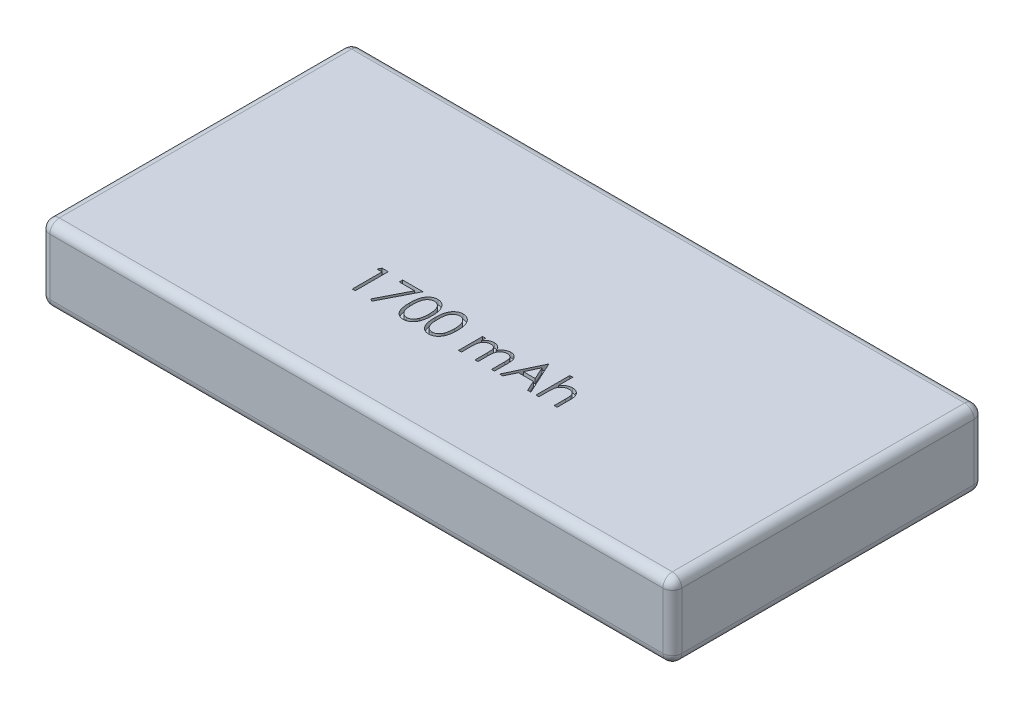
from build123d import *

# Parameters (mm, degrees)
SKETCH1_W           = 67
SKETCH1_H           = 33
BOSS_EXTRUDE1_DEPTH = 8
FILLET1_R           = 1
CUT_EXTRUDE1_DEPTH  = 0.5


with BuildPart() as part:
    # Sketch1 → Boss-Extrude1 (new body)
    with BuildSketch(Plane(origin=(0, 0, 0), x_dir=(1, 0, 0), z_dir=(0, 1, 0))):
        with Locations((33.5, 16.5)):
            Rectangle(SKETCH1_W, SKETCH1_H)
    extrude(amount=BOSS_EXTRUDE1_DEPTH)

    # Fillet1
    fillet1_edges = [part.edges().sort_by_distance(p)[0] for p in [
        (67, 8, -16.5),
        (33.5, 8, -33),
        (0, 8, -16.5),
        (33.5, 0, -33),
        (67, 0, -16.5),
        (33.5, 0, 0),
        (0, 0, -16.5),
        (0, 4, -33),
        (67, 4, -33),
        (67, 4, 0),
        (0, 4, 0),
        (33.5, 8, 0),
    ]]
    fillet(fillet1_edges, radius=FILLET1_R)

    # Sketch2 → Cut-Extrude1 (cut)
    # profile 1 of 7: a face of its own
    with BuildSketch(Plane(origin=(0, 8, 0), x_dir=(1, 0, 0), z_dir=(0, 1, 0))):
        Polygon((22.73427484, 13.5), (23.381410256, 13.5), (23.381410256, 10), (23.067307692, 10), (23.067307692, 13.141025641), (22.528846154, 13.141025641), align=None)
    # profile 2 of 7: a face of its own
    with BuildSketch(Plane(origin=(0, 8, 0), x_dir=(1, 0, 0), z_dir=(0, 1, 0))):
        Polygon((24.907051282, 13.5), (27.060897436, 13.5), (25.221153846, 9.91025641), (24.949819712, 10.059595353), (26.528745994, 13.141025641), (24.907051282, 13.141025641), align=None)
    # profile 3 of 7: a face of its own
    with BuildSketch(Plane(origin=(0, 8, 0), x_dir=(1, 0, 0), z_dir=(0, 1, 0))):
        with BuildLine():
            add(Edge.make_bspline(
                [(27.375, 11.748597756), (27.375328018, 11.804695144), (27.375965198, 11.913665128), (27.383053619, 12.07244977), (27.394828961, 12.221410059), (27.410966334, 12.360553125), (27.430604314, 12.48991489), (27.456819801, 12.609149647), (27.486632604, 12.718809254), (27.52118505, 12.819251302), (27.560172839, 12.911829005), (27.602607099, 12.998254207), (27.650171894, 13.078396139), (27.700148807, 13.153533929), (27.754560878, 13.222437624), (27.811859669, 13.286080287), (27.874281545, 13.342991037), (27.939704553, 13.394837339), (28.008721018, 13.440286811), (28.079363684, 13.48031955), (28.15211879, 13.514519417), (28.227184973, 13.541409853), (28.30388753, 13.5636207), (28.382494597, 13.578809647), (28.463135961, 13.588366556), (28.517567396, 13.589280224), (28.545172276, 13.58974359)],
                knots=[0, 0, 0, 0, 1.646270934, 3.197905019, 4.663502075, 6.030701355, 7.308322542, 8.50163776, 9.611534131, 10.641858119, 11.616356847, 12.558055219, 13.465016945, 14.349605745, 15.204443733, 16.039544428, 16.859896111, 17.680448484, 18.487036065, 19.28249412, 20.06191084, 20.843045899, 21.620316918, 22.403196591, 23.190181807, 24, 24, 24, 24], degree=3))
            add(Edge.make_bspline(
                [(28.545172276, 13.58974359), (28.573007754, 13.589255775), (28.628363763, 13.588285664), (28.710204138, 13.578961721), (28.79015382, 13.563490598), (28.867871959, 13.541569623), (28.943996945, 13.514373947), (29.017933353, 13.48028683), (29.090140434, 13.440607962), (29.159470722, 13.393984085), (29.226685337, 13.342001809), (29.2901333, 13.28323914), (29.349820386, 13.218289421), (29.406495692, 13.147847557), (29.458551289, 13.070562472), (29.508124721, 12.987778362), (29.552496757, 12.898047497), (29.595231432, 12.80286703), (29.632118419, 12.699603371), (29.665384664, 12.58883861), (29.692263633, 12.469264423), (29.714652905, 12.341508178), (29.731997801, 12.205100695), (29.744630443, 12.060334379), (29.751303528, 11.907113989), (29.752560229, 11.80235614), (29.753205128, 11.748597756)],
                knots=[0, 0, 0, 0, 0.810914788, 1.612654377, 2.396697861, 3.181598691, 3.963628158, 4.749916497, 5.551656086, 6.361998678, 7.18212741, 8.025565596, 8.878627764, 9.750805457, 10.657531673, 11.591944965, 12.560506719, 13.57287815, 14.630710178, 15.753379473, 16.941251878, 18.199788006, 19.531962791, 20.947069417, 22.433333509, 24, 24, 24, 24], degree=3))
            add(Edge.make_bspline(
                [(29.753205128, 11.748597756), (29.752553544, 11.695073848), (29.751283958, 11.590784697), (29.744705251, 11.438253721), (29.73174662, 11.294255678), (29.715536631, 11.158445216), (29.693085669, 11.031387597), (29.665480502, 10.912643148), (29.634830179, 10.801699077), (29.596995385, 10.699464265), (29.555584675, 10.604512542), (29.510529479, 10.515845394), (29.462259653, 10.432679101), (29.409670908, 10.355679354), (29.353617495, 10.284300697), (29.292899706, 10.219803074), (29.229229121, 10.160632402), (29.161816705, 10.107980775), (29.091405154, 10.06189597), (29.019446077, 10.02068212), (28.944662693, 9.987449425), (28.868749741, 9.958914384), (28.790621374, 9.937113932), (28.710374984, 9.922040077), (28.628418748, 9.911468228), (28.573017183, 9.910661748), (28.545172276, 9.91025641)],
                knots=[0, 0, 0, 0, 1.561518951, 3.042555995, 4.452378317, 5.7783523, 7.031515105, 8.214008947, 9.334062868, 10.386615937, 11.391082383, 12.354592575, 13.286541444, 14.194233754, 15.072674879, 15.931287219, 16.775624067, 17.606195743, 18.42308326, 19.229000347, 20.022332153, 20.807536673, 21.593273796, 22.3848459, 23.188221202, 24, 24, 24, 24], degree=3))
            add(Edge.make_bspline(
                [(28.545172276, 9.91025641), (28.517568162, 9.910722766), (28.463138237, 9.911642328), (28.382485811, 9.921156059), (28.304203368, 9.936451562), (28.227904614, 9.957868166), (28.153198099, 9.984083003), (28.081101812, 10.018236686), (28.010814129, 10.057570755), (27.942522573, 10.102366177), (27.877510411, 10.15368786), (27.815411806, 10.210452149), (27.757786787, 10.27407556), (27.704152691, 10.343553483), (27.653178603, 10.418246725), (27.60628923, 10.499175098), (27.562918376, 10.586017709), (27.523274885, 10.67933562), (27.488126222, 10.780490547), (27.457078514, 10.890639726), (27.432564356, 11.010755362), (27.411581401, 11.139872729), (27.394657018, 11.278546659), (27.383102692, 11.426852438), (27.375961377, 11.584697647), (27.375326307, 11.692967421), (27.375, 11.748597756)],
                knots=[0, 0, 0, 0, 0.810891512, 1.598919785, 2.382837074, 3.152667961, 3.926044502, 4.706494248, 5.493654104, 6.291793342, 7.103789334, 7.925228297, 8.761435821, 9.622817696, 10.50288917, 11.416980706, 12.369136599, 13.353924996, 14.394355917, 15.514179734, 16.714354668, 17.994756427, 19.357759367, 20.818452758, 22.365282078, 24, 24, 24, 24], degree=3))
        make_face()
        with BuildLine():
            add(Edge.make_bspline(
                [(27.689102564, 11.75), (27.689222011, 11.703251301), (27.689453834, 11.612521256), (27.695510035, 11.480677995), (27.703760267, 11.357707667), (27.714401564, 11.24345413), (27.730204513, 11.138304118), (27.747911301, 11.041534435), (27.76945939, 10.953657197), (27.794954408, 10.874069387), (27.823993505, 10.801420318), (27.855699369, 10.733819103), (27.889760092, 10.670467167), (27.927879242, 10.611933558), (27.969394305, 10.558027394), (28.013367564, 10.507794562), (28.061440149, 10.462997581), (28.127943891, 10.409270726), (28.215740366, 10.353751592), (28.326360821, 10.305405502), (28.440029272, 10.275023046), (28.517180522, 10.27115929), (28.555689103, 10.269230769)],
                knots=[0, 0, 0, 0, 1.459021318, 2.831673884, 4.118529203, 5.306027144, 6.411944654, 7.436330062, 8.375795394, 9.233974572, 10.042671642, 10.816086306, 11.563610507, 12.285937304, 12.993564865, 13.685989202, 14.367179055, 15.041617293, 16.353048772, 17.594441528, 18.799311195, 20, 20, 20, 20], degree=3))
            add(Edge.make_bspline(
                [(28.555689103, 10.269230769), (28.594446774, 10.27082855), (28.671882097, 10.274020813), (28.785015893, 10.30481955), (28.894846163, 10.35128909), (28.980918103, 10.406236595), (29.046400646, 10.458564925), (29.093317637, 10.503179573), (29.136379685, 10.55313544), (29.17722176, 10.607034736), (29.214680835, 10.66590722), (29.248743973, 10.729469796), (29.279827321, 10.797898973), (29.297536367, 10.845668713), (29.306590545, 10.870092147)],
                knots=[0, 0, 0, 0, 1.353760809, 2.704726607, 4.075137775, 5.516104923, 6.260822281, 7.007110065, 7.778089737, 8.566572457, 9.372053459, 10.217411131, 11.088608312, 12, 12, 12, 12], degree=3))
            add(Edge.make_bspline(
                [(29.306590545, 10.870092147), (29.317142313, 10.901321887), (29.338566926, 10.964731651), (29.366178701, 11.063095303), (29.3879241, 11.166298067), (29.407487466, 11.273723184), (29.420840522, 11.386162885), (29.431588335, 11.503269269), (29.437919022, 11.625130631), (29.438703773, 11.707925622), (29.439102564, 11.75)],
                knots=[0, 0, 0, 0, 0.884706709, 1.796334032, 2.740027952, 3.714592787, 4.726048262, 5.777819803, 6.87074269, 8, 8, 8, 8], degree=3))
            add(Edge.make_bspline(
                [(29.439102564, 11.75), (29.438552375, 11.792067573), (29.437476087, 11.874360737), (29.433362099, 11.994878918), (29.422738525, 12.109346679), (29.410939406, 12.218257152), (29.393542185, 12.321007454), (29.374784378, 12.418457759), (29.349583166, 12.509400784), (29.322663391, 12.595260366), (29.291852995, 12.675061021), (29.257937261, 12.749174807), (29.221715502, 12.817959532), (29.182373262, 12.881226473), (29.140377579, 12.939259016), (29.09462003, 12.990893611), (29.046915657, 13.037730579), (28.980098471, 13.091193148), (28.892624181, 13.145704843), (28.783778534, 13.195870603), (28.67050789, 13.224678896), (28.593934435, 13.228740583), (28.555689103, 13.230769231)],
                knots=[0, 0, 0, 0, 1.31362396, 2.569729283, 3.763502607, 4.902122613, 5.988968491, 7.01645872, 7.998833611, 8.933434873, 9.825090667, 10.667526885, 11.477055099, 12.250526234, 12.991942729, 13.710640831, 14.402115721, 15.076753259, 16.378508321, 17.609869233, 18.806226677, 20, 20, 20, 20], degree=3))
            add(Edge.make_bspline(
                [(28.555689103, 13.230769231), (28.51697851, 13.228737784), (28.439486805, 13.22467119), (28.32503885, 13.195977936), (28.215334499, 13.14596497), (28.128091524, 13.091012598), (28.061227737, 13.038674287), (28.014145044, 12.993287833), (27.969998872, 12.943641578), (27.929331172, 12.889239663), (27.891241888, 12.830774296), (27.856260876, 12.767785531), (27.824743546, 12.699954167), (27.79565901, 12.627337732), (27.770086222, 12.547756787), (27.748992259, 12.459987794), (27.729505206, 12.363525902), (27.715709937, 12.257806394), (27.703446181, 12.14352424), (27.695564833, 12.020246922), (27.689433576, 11.888182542), (27.689215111, 11.796983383), (27.689102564, 11.75)],
                knots=[0, 0, 0, 0, 1.207732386, 2.417664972, 3.655092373, 4.956220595, 5.625982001, 6.301752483, 6.994047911, 7.697131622, 8.419323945, 9.170223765, 9.943494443, 10.752040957, 11.610060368, 12.549350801, 13.567764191, 14.679664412, 15.874934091, 17.154273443, 18.533957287, 20, 20, 20, 20], degree=3))
        make_face(mode=Mode.SUBTRACT)
    # profile 4 of 7: a face of its own
    with BuildSketch(Plane(origin=(0, 8, 0), x_dir=(1, 0, 0), z_dir=(0, 1, 0))):
        with BuildLine():
            add(Edge.make_bspline(
                [(30.067307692, 11.748597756), (30.06763571, 11.804695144), (30.06827289, 11.913665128), (30.075361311, 12.07244977), (30.087136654, 12.221410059), (30.103274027, 12.360553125), (30.122912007, 12.48991489), (30.149127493, 12.609149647), (30.178940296, 12.718809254), (30.213492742, 12.819251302), (30.252480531, 12.911829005), (30.294914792, 12.998254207), (30.342479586, 13.078396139), (30.392456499, 13.153533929), (30.446868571, 13.222437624), (30.504167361, 13.286080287), (30.566589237, 13.342991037), (30.632012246, 13.394837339), (30.70102871, 13.440286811), (30.771671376, 13.48031955), (30.844426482, 13.514519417), (30.919492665, 13.541409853), (30.996195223, 13.5636207), (31.074802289, 13.578809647), (31.155443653, 13.588366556), (31.209875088, 13.589280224), (31.237479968, 13.58974359)],
                knots=[0, 0, 0, 0, 1.646270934, 3.197905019, 4.663502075, 6.030701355, 7.308322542, 8.50163776, 9.611534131, 10.641858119, 11.616356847, 12.558055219, 13.465016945, 14.349605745, 15.204443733, 16.039544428, 16.859896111, 17.680448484, 18.487036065, 19.28249412, 20.06191084, 20.843045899, 21.620316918, 22.403196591, 23.190181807, 24, 24, 24, 24], degree=3))
            add(Edge.make_bspline(
                [(31.237479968, 13.58974359), (31.265315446, 13.589255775), (31.320671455, 13.588285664), (31.402511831, 13.578961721), (31.482461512, 13.563490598), (31.560179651, 13.541569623), (31.636304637, 13.514373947), (31.710241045, 13.48028683), (31.782448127, 13.440607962), (31.851778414, 13.393984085), (31.91899303, 13.342001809), (31.982440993, 13.28323914), (32.042128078, 13.218289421), (32.098803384, 13.147847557), (32.150858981, 13.070562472), (32.200432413, 12.987778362), (32.244804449, 12.898047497), (32.287539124, 12.80286703), (32.324426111, 12.699603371), (32.357692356, 12.58883861), (32.384571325, 12.469264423), (32.406960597, 12.341508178), (32.424305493, 12.205100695), (32.436938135, 12.060334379), (32.44361122, 11.907113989), (32.444867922, 11.80235614), (32.445512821, 11.748597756)],
                knots=[0, 0, 0, 0, 0.810914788, 1.612654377, 2.396697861, 3.181598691, 3.963628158, 4.749916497, 5.551656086, 6.361998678, 7.18212741, 8.025565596, 8.878627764, 9.750805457, 10.657531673, 11.591944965, 12.560506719, 13.57287815, 14.630710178, 15.753379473, 16.941251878, 18.199788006, 19.531962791, 20.947069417, 22.433333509, 24, 24, 24, 24], degree=3))
            add(Edge.make_bspline(
                [(32.445512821, 11.748597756), (32.444861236, 11.695073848), (32.44359165, 11.590784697), (32.437012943, 11.438253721), (32.424054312, 11.294255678), (32.407844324, 11.158445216), (32.385393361, 11.031387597), (32.357788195, 10.912643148), (32.327137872, 10.801699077), (32.289303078, 10.699464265), (32.247892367, 10.604512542), (32.202837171, 10.515845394), (32.154567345, 10.432679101), (32.1019786, 10.355679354), (32.045925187, 10.284300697), (31.985207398, 10.219803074), (31.921536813, 10.160632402), (31.854124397, 10.107980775), (31.783712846, 10.06189597), (31.711753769, 10.02068212), (31.636970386, 9.987449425), (31.561057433, 9.958914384), (31.482929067, 9.937113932), (31.402682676, 9.922040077), (31.32072644, 9.911468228), (31.265324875, 9.910661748), (31.237479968, 9.91025641)],
                knots=[0, 0, 0, 0, 1.561518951, 3.042555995, 4.452378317, 5.7783523, 7.031515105, 8.214008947, 9.334062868, 10.386615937, 11.391082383, 12.354592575, 13.286541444, 14.194233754, 15.072674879, 15.931287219, 16.775624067, 17.606195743, 18.42308326, 19.229000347, 20.022332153, 20.807536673, 21.593273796, 22.3848459, 23.188221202, 24, 24, 24, 24], degree=3))
            add(Edge.make_bspline(
                [(31.237479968, 9.91025641), (31.209875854, 9.910722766), (31.155445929, 9.911642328), (31.074793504, 9.921156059), (30.99651106, 9.936451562), (30.920212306, 9.957868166), (30.845505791, 9.984083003), (30.773409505, 10.018236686), (30.703121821, 10.057570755), (30.634830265, 10.102366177), (30.569818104, 10.15368786), (30.507719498, 10.210452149), (30.450094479, 10.27407556), (30.396460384, 10.343553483), (30.345486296, 10.418246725), (30.298596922, 10.499175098), (30.255226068, 10.586017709), (30.215582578, 10.67933562), (30.180433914, 10.780490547), (30.149386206, 10.890639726), (30.124872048, 11.010755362), (30.103889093, 11.139872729), (30.08696471, 11.278546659), (30.075410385, 11.426852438), (30.06826907, 11.584697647), (30.067633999, 11.692967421), (30.067307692, 11.748597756)],
                knots=[0, 0, 0, 0, 0.810891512, 1.598919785, 2.382837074, 3.152667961, 3.926044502, 4.706494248, 5.493654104, 6.291793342, 7.103789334, 7.925228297, 8.761435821, 9.622817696, 10.50288917, 11.416980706, 12.369136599, 13.353924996, 14.394355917, 15.514179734, 16.714354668, 17.994756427, 19.357759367, 20.818452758, 22.365282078, 24, 24, 24, 24], degree=3))
        make_face()
        with BuildLine():
            add(Edge.make_bspline(
                [(30.381410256, 11.75), (30.381529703, 11.703251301), (30.381761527, 11.612521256), (30.387817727, 11.480677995), (30.396067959, 11.357707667), (30.406709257, 11.24345413), (30.422512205, 11.138304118), (30.440218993, 11.041534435), (30.461767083, 10.953657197), (30.4872621, 10.874069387), (30.516301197, 10.801420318), (30.548007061, 10.733819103), (30.582067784, 10.670467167), (30.620186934, 10.611933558), (30.661701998, 10.558027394), (30.705675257, 10.507794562), (30.753747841, 10.462997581), (30.820251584, 10.409270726), (30.908048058, 10.353751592), (31.018668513, 10.305405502), (31.132336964, 10.275023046), (31.209488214, 10.27115929), (31.247996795, 10.269230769)],
                knots=[0, 0, 0, 0, 1.459021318, 2.831673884, 4.118529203, 5.306027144, 6.411944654, 7.436330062, 8.375795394, 9.233974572, 10.042671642, 10.816086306, 11.563610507, 12.285937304, 12.993564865, 13.685989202, 14.367179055, 15.041617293, 16.353048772, 17.594441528, 18.799311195, 20, 20, 20, 20], degree=3))
            add(Edge.make_bspline(
                [(31.247996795, 10.269230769), (31.286754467, 10.27082855), (31.36418979, 10.274020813), (31.477323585, 10.30481955), (31.587153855, 10.35128909), (31.673225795, 10.406236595), (31.738708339, 10.458564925), (31.785625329, 10.503179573), (31.828687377, 10.55313544), (31.869529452, 10.607034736), (31.906988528, 10.66590722), (31.941051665, 10.729469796), (31.972135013, 10.797898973), (31.989844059, 10.845668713), (31.998898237, 10.870092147)],
                knots=[0, 0, 0, 0, 1.353760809, 2.704726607, 4.075137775, 5.516104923, 6.260822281, 7.007110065, 7.778089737, 8.566572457, 9.372053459, 10.217411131, 11.088608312, 12, 12, 12, 12], degree=3))
            add(Edge.make_bspline(
                [(31.998898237, 10.870092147), (32.009450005, 10.901321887), (32.030874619, 10.964731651), (32.058486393, 11.063095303), (32.080231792, 11.166298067), (32.099795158, 11.273723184), (32.113148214, 11.386162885), (32.123896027, 11.503269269), (32.130226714, 11.625130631), (32.131011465, 11.707925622), (32.131410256, 11.75)],
                knots=[0, 0, 0, 0, 0.884706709, 1.796334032, 2.740027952, 3.714592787, 4.726048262, 5.777819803, 6.87074269, 8, 8, 8, 8], degree=3))
            add(Edge.make_bspline(
                [(32.131410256, 11.75), (32.130860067, 11.792067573), (32.129783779, 11.874360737), (32.125669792, 11.994878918), (32.115046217, 12.109346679), (32.103247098, 12.218257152), (32.085849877, 12.321007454), (32.06709207, 12.418457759), (32.041890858, 12.509400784), (32.014971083, 12.595260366), (31.984160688, 12.675061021), (31.950244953, 12.749174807), (31.914023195, 12.817959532), (31.874680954, 12.881226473), (31.832685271, 12.939259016), (31.786927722, 12.990893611), (31.739223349, 13.037730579), (31.672406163, 13.091193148), (31.584931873, 13.145704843), (31.476086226, 13.195870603), (31.362815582, 13.224678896), (31.286242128, 13.228740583), (31.247996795, 13.230769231)],
                knots=[0, 0, 0, 0, 1.31362396, 2.569729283, 3.763502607, 4.902122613, 5.988968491, 7.01645872, 7.998833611, 8.933434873, 9.825090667, 10.667526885, 11.477055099, 12.250526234, 12.991942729, 13.710640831, 14.402115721, 15.076753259, 16.378508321, 17.609869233, 18.806226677, 20, 20, 20, 20], degree=3))
            add(Edge.make_bspline(
                [(31.247996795, 13.230769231), (31.209286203, 13.228737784), (31.131794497, 13.22467119), (31.017346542, 13.195977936), (30.907642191, 13.14596497), (30.820399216, 13.091012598), (30.75353543, 13.038674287), (30.706452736, 12.993287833), (30.662306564, 12.943641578), (30.621638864, 12.889239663), (30.583549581, 12.830774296), (30.548568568, 12.767785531), (30.517051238, 12.699954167), (30.487966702, 12.627337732), (30.462393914, 12.547756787), (30.441299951, 12.459987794), (30.421812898, 12.363525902), (30.408017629, 12.257806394), (30.395753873, 12.14352424), (30.387872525, 12.020246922), (30.381741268, 11.888182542), (30.381522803, 11.796983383), (30.381410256, 11.75)],
                knots=[0, 0, 0, 0, 1.207732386, 2.417664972, 3.655092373, 4.956220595, 5.625982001, 6.301752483, 6.994047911, 7.697131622, 8.419323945, 9.170223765, 9.943494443, 10.752040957, 11.610060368, 12.549350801, 13.567764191, 14.679664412, 15.874934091, 17.154273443, 18.533957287, 20, 20, 20, 20], degree=3))
        make_face(mode=Mode.SUBTRACT)
    # profile 5 of 7: a face of its own
    with BuildSketch(Plane(origin=(0, 8, 0), x_dir=(1, 0, 0), z_dir=(0, 1, 0))):
        with BuildLine():
            Line((34.330128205, 12.557692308), (34.644230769, 12.557692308))
            Line((34.644230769, 12.557692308), (34.644230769, 12.11318109))
            add(Edge.make_bspline(
                [(34.644230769, 12.11318109), (34.672514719, 12.152068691), (34.726709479, 12.226581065), (34.815575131, 12.324771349), (34.904351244, 12.408099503), (34.968284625, 12.451842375), (34.998998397, 12.472856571)],
                knots=[0, 0, 0, 0, 1.134379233, 2.173579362, 3.122582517, 4, 4, 4, 4], degree=3))
            add(Edge.make_bspline(
                [(34.998998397, 12.472856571), (35.04086306, 12.492861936), (35.123860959, 12.532523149), (35.255280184, 12.572756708), (35.389754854, 12.597481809), (35.480563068, 12.600863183), (35.526241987, 12.602564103)],
                knots=[0, 0, 0, 0, 1.014936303, 2.012140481, 3.000054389, 4, 4, 4, 4], degree=3))
            add(Edge.make_bspline(
                [(35.526241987, 12.602564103), (35.557134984, 12.601518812), (35.618270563, 12.599450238), (35.708854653, 12.585990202), (35.796713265, 12.562724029), (35.881327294, 12.530316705), (35.961047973, 12.491070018), (36.034137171, 12.445020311), (36.099761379, 12.393323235), (36.157887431, 12.333644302), (36.210156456, 12.264307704), (36.258235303, 12.183443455), (36.302660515, 12.089235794), (36.327281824, 12.020869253), (36.340244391, 11.984875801)],
                knots=[0, 0, 0, 0, 1.009824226, 1.998387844, 2.986035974, 3.974953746, 4.955485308, 5.885931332, 6.793869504, 7.679848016, 8.601185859, 9.625726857, 10.749998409, 12, 12, 12, 12], degree=3))
            add(Edge.make_bspline(
                [(36.340244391, 11.984875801), (36.353955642, 12.009600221), (36.38093746, 12.058254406), (36.426243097, 12.127112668), (36.473710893, 12.19151946), (36.523745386, 12.251525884), (36.576169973, 12.306835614), (36.631231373, 12.357631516), (36.688616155, 12.40413173), (36.768408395, 12.458454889), (36.872221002, 12.516156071), (37.003109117, 12.566184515), (37.139259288, 12.597100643), (37.231676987, 12.600730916), (37.278345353, 12.602564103)],
                knots=[0, 0, 0, 0, 0.86119277, 1.694706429, 2.50939023, 3.298075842, 4.073795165, 4.829715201, 5.57930267, 6.321991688, 7.768977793, 9.186738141, 10.579381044, 12, 12, 12, 12], degree=3))
            add(Edge.make_bspline(
                [(37.278345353, 12.602564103), (37.321226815, 12.600946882), (37.405150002, 12.597781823), (37.527327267, 12.57292835), (37.641269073, 12.530250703), (37.746746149, 12.472017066), (37.841905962, 12.398837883), (37.924622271, 12.311769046), (37.994392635, 12.211426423), (38.039971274, 12.117034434), (38.070886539, 12.033699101), (38.089947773, 11.96269281), (38.106787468, 11.884541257), (38.120768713, 11.799150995), (38.130987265, 11.706220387), (38.138557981, 11.605901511), (38.143682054, 11.498116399), (38.144044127, 11.423750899), (38.144230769, 11.385416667)],
                knots=[0, 0, 0, 0, 1.209669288, 2.367440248, 3.500751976, 4.631527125, 5.755587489, 6.87532382, 8.007944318, 9.190864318, 9.82315674, 10.514484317, 11.263564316, 12.079023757, 12.955305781, 13.901327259, 14.918167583, 16, 16, 16, 16], degree=3))
            Line((38.144230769, 11.385416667), (38.144230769, 10))
            Line((38.144230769, 10), (37.830128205, 10))
            Line((37.830128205, 10), (37.830128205, 11.38681891))
            add(Edge.make_bspline(
                [(37.830128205, 11.38681891), (37.830050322, 11.419539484), (37.829900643, 11.482423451), (37.827207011, 11.572675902), (37.822131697, 11.654944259), (37.816197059, 11.729116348), (37.807953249, 11.795365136), (37.797307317, 11.853557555), (37.786029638, 11.904151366), (37.767293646, 11.960237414), (37.737345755, 12.022107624), (37.691728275, 12.0888312), (37.634258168, 12.146912), (37.567898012, 12.197330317), (37.492349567, 12.238323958), (37.409084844, 12.267599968), (37.318620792, 12.285722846), (37.255998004, 12.287528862), (37.223657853, 12.288461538)],
                knots=[0, 0, 0, 0, 1.253487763, 2.409012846, 3.458416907, 4.410876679, 5.259312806, 6.014470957, 6.676830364, 7.243083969, 8.276244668, 9.299465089, 10.325150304, 11.392391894, 12.482080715, 13.603491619, 14.762376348, 16, 16, 16, 16], degree=3))
            add(Edge.make_bspline(
                [(37.223657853, 12.288461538), (37.183987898, 12.287045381), (37.105584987, 12.284246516), (36.991139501, 12.255672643), (36.881168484, 12.212592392), (36.778953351, 12.150159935), (36.684925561, 12.075351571), (36.604025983, 11.986401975), (36.537193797, 11.885772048), (36.491939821, 11.792625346), (36.46335052, 11.708955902), (36.444473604, 11.63585853), (36.429790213, 11.552776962), (36.416019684, 11.460269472), (36.407031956, 11.357699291), (36.398863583, 11.24554089), (36.39504272, 11.123456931), (36.394508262, 11.038830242), (36.394230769, 10.994891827)],
                knots=[0, 0, 0, 0, 1.090531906, 2.155305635, 3.229839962, 4.33261226, 5.44038871, 6.529323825, 7.629011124, 8.757537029, 9.370236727, 10.061839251, 10.834451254, 11.692844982, 12.636905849, 13.66920014, 14.789842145, 16, 16, 16, 16], degree=3))
            Line((36.394230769, 10.994891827), (36.394230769, 10))
            Line((36.394230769, 10), (36.080128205, 10))
            Line((36.080128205, 10), (36.080128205, 11.300580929))
            add(Edge.make_bspline(
                [(36.080128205, 11.300580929), (36.080048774, 11.337274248), (36.079895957, 11.407868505), (36.07721964, 11.509102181), (36.072133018, 11.601183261), (36.06625247, 11.684004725), (36.057792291, 11.757416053), (36.048182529, 11.821810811), (36.036833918, 11.877027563), (36.018044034, 11.937590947), (35.989329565, 12.00431187), (35.943141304, 12.075452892), (35.885533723, 12.137720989), (35.817962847, 12.190879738), (35.741957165, 12.234821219), (35.657973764, 12.266480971), (35.566768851, 12.28490526), (35.503891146, 12.287253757), (35.471554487, 12.288461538)],
                knots=[0, 0, 0, 0, 1.320475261, 2.540461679, 3.643808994, 4.639130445, 5.527981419, 6.302341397, 6.981980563, 7.553956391, 8.582137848, 9.585246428, 10.591171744, 11.620968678, 12.668337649, 13.738356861, 14.836885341, 16, 16, 16, 16], degree=3))
            add(Edge.make_bspline(
                [(35.471554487, 12.288461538), (35.433538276, 12.286931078), (35.357773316, 12.283880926), (35.246471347, 12.256426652), (35.138985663, 12.213422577), (35.037030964, 12.153762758), (34.943356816, 12.07986368), (34.861348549, 11.992948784), (34.792406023, 11.89409975), (34.746674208, 11.801935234), (34.717175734, 11.720361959), (34.697580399, 11.651011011), (34.680740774, 11.574010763), (34.668226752, 11.489123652), (34.656146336, 11.396902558), (34.650316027, 11.296888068), (34.644644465, 11.18916598), (34.64437205, 11.114793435), (34.644230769, 11.076221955)],
                knots=[0, 0, 0, 0, 1.098833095, 2.189935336, 3.297829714, 4.440610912, 5.596351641, 6.740013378, 7.886572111, 9.072425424, 9.705826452, 10.395263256, 11.156850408, 11.985370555, 12.878090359, 13.847760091, 14.883794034, 16, 16, 16, 16], degree=3))
            Line((34.644230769, 11.076221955), (34.644230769, 10))
            Line((34.644230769, 10), (34.330128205, 10))
            Line((34.330128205, 10), (34.330128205, 12.557692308))
        make_face()
    # profile 6 of 7: a face of its own
    with BuildSketch(Plane(origin=(0, 8, 0), x_dir=(1, 0, 0), z_dir=(0, 1, 0))):
        Polygon((40.387820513, 13.5), (42.003205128, 10), (41.661758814, 10), (41.144330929, 11.121794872), (39.557692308, 11.121794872), (39.026241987, 10), (38.682692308, 10), (40.342948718, 13.5), align=None)
        Polygon((40.361879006, 12.817107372), (39.728766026, 11.480769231), (40.978866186, 11.480769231), align=None, mode=Mode.SUBTRACT)
    # profile 7 of 7: a face of its own
    with BuildSketch(Plane(origin=(0, 8, 0), x_dir=(1, 0, 0), z_dir=(0, 1, 0))):
        with BuildLine():
            Line((42.541666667, 13.58974359), (42.855769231, 13.58974359))
            Line((42.855769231, 13.58974359), (42.855769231, 12.074619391))
            add(Edge.make_bspline(
                [(42.855769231, 12.074619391), (42.889486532, 12.116763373), (42.955135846, 12.198819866), (43.065631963, 12.305881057), (43.179102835, 12.398679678), (43.299467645, 12.472550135), (43.424518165, 12.530906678), (43.55478181, 12.572294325), (43.690282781, 12.597745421), (43.782307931, 12.600943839), (43.828926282, 12.602564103)],
                knots=[0, 0, 0, 0, 1.125788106, 2.19196713, 3.20547328, 4.180437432, 5.132270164, 6.079753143, 7.027236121, 8, 8, 8, 8], degree=3))
            add(Edge.make_bspline(
                [(43.828926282, 12.602564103), (43.876256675, 12.600818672), (43.96889367, 12.597402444), (44.103775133, 12.570389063), (44.229736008, 12.524231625), (44.346401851, 12.4610646), (44.451226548, 12.382391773), (44.544076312, 12.29156025), (44.619917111, 12.186286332), (44.671516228, 12.089030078), (44.705089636, 12.002491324), (44.726341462, 11.928254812), (44.74436066, 11.845532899), (44.760060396, 11.754368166), (44.770523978, 11.654322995), (44.778928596, 11.545848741), (44.78490505, 11.428951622), (44.785136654, 11.348031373), (44.78525641, 11.306189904)],
                knots=[0, 0, 0, 0, 1.235656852, 2.418478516, 3.575258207, 4.727955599, 5.870717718, 6.98870536, 8.107142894, 9.245821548, 9.854588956, 10.528768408, 11.260415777, 12.065282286, 12.943670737, 13.886611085, 14.907229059, 16, 16, 16, 16], degree=3))
            Line((44.78525641, 11.306189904), (44.78525641, 10))
            Line((44.78525641, 10), (44.471153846, 10))
            Line((44.471153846, 10), (44.471153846, 11.203125))
            add(Edge.make_bspline(
                [(44.471153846, 11.203125), (44.470963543, 11.23794767), (44.470599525, 11.30455751), (44.469396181, 11.399923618), (44.466709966, 11.486419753), (44.46236914, 11.563768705), (44.457803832, 11.632078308), (44.451520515, 11.691249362), (44.444210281, 11.741363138), (44.4376415, 11.771527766), (44.434695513, 11.78505609)],
                knots=[0, 0, 0, 0, 1.430932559, 2.737130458, 3.918967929, 4.986496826, 5.920444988, 6.731744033, 7.431208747, 8, 8, 8, 8], degree=3))
            add(Edge.make_bspline(
                [(44.434695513, 11.78505609), (44.423271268, 11.824750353), (44.401308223, 11.901062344), (44.350260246, 12.004724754), (44.286501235, 12.093109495), (44.208653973, 12.165023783), (44.118095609, 12.221435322), (44.014235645, 12.260503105), (43.898051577, 12.284750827), (43.816200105, 12.28719013), (43.77353766, 12.288461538)],
                knots=[0, 0, 0, 0, 1.090059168, 2.095632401, 3.037101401, 3.955032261, 4.878929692, 5.839099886, 6.873700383, 8, 8, 8, 8], degree=3))
            add(Edge.make_bspline(
                [(43.77353766, 12.288461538), (43.748269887, 12.287985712), (43.698265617, 12.287044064), (43.624116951, 12.277590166), (43.552187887, 12.262141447), (43.48178571, 12.241236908), (43.414402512, 12.212791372), (43.348074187, 12.179861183), (43.284679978, 12.139552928), (43.223094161, 12.09432716), (43.165776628, 12.0442574), (43.112449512, 11.991410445), (43.064911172, 11.935135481), (43.021842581, 11.876335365), (42.984664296, 11.814203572), (42.952211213, 11.749339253), (42.924675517, 11.681657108), (42.910992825, 11.634682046), (42.904146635, 11.611177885)],
                knots=[0, 0, 0, 0, 1.024319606, 2.027102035, 3.025350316, 4.005802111, 5.00026367, 5.987881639, 7.005602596, 8.042517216, 9.083927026, 10.089214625, 11.084353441, 12.06828073, 13.041928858, 14.016821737, 15.00770877, 16, 16, 16, 16], degree=3))
            add(Edge.make_bspline(
                [(42.904146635, 11.611177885), (42.900207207, 11.594156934), (42.891622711, 11.557066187), (42.882307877, 11.495891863), (42.873970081, 11.424805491), (42.866921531, 11.34391489), (42.862598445, 11.252923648), (42.857940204, 11.152452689), (42.85620619, 11.041872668), (42.855919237, 10.964977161), (42.855769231, 10.924779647)],
                knots=[0, 0, 0, 0, 0.607992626, 1.324890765, 2.152360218, 3.099583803, 4.150613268, 5.323148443, 6.60066238, 8, 8, 8, 8], degree=3))
            Line((42.855769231, 10.924779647), (42.855769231, 10))
            Line((42.855769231, 10), (42.541666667, 10))
            Line((42.541666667, 10), (42.541666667, 13.58974359))
        make_face()
    extrude(amount=-CUT_EXTRUDE1_DEPTH, mode=Mode.SUBTRACT)


solid = part.part
